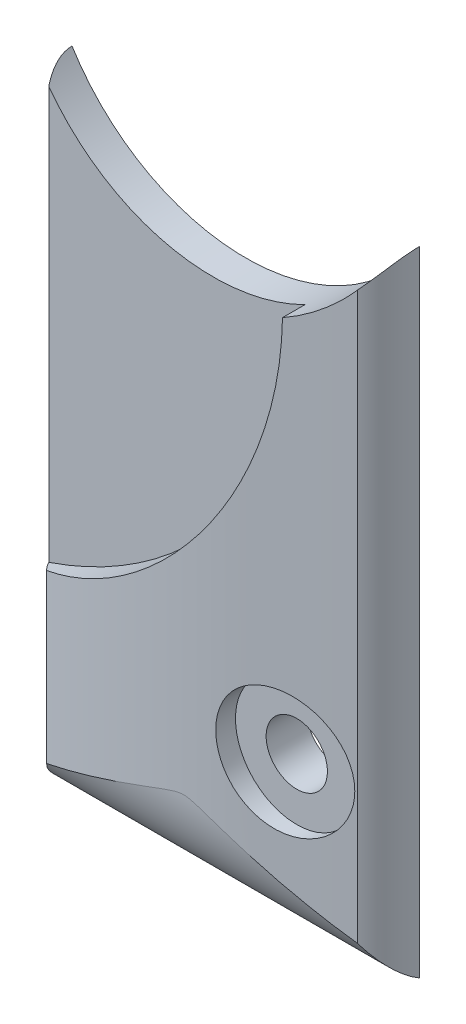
ISO-10303-21;
HEADER;
FILE_DESCRIPTION(('STEP AP214'),'2;1');
FILE_NAME('part.step','',(''),(''),'','','');
FILE_SCHEMA(('AUTOMOTIVE_DESIGN { 1 0 10303 214 1 1 1 1 }'));
ENDSEC;
DATA;
#1=APPLICATION_CONTEXT('core data for automotive mechanical design processes');
#2=APPLICATION_PROTOCOL_DEFINITION('international standard','automotive_design',2000,#1);
#3=PRODUCT_CONTEXT('',#1,'mechanical');
#4=PRODUCT('Part','Part','',(#3));
#5=PRODUCT_RELATED_PRODUCT_CATEGORY('part','',(#4));
#6=PRODUCT_DEFINITION_FORMATION('','',#4);
#7=PRODUCT_DEFINITION_CONTEXT('part definition',#1,'design');
#8=PRODUCT_DEFINITION('design','',#6,#7);
#9=PRODUCT_DEFINITION_SHAPE('','',#8);
#10=(LENGTH_UNIT() NAMED_UNIT(*) SI_UNIT(.MILLI.,.METRE.));
#11=(NAMED_UNIT(*) PLANE_ANGLE_UNIT() SI_UNIT($,.RADIAN.));
#12=(NAMED_UNIT(*) SI_UNIT($,.STERADIAN.) SOLID_ANGLE_UNIT());
#13=UNCERTAINTY_MEASURE_WITH_UNIT(LENGTH_MEASURE(1.E-05),#10,'distance_accuracy_value','');
#14=(GEOMETRIC_REPRESENTATION_CONTEXT(3) GLOBAL_UNCERTAINTY_ASSIGNED_CONTEXT((#13)) GLOBAL_UNIT_ASSIGNED_CONTEXT((#10,
#11,#12)) REPRESENTATION_CONTEXT('',''));
#15=CARTESIAN_POINT('',(0.,0.,0.));
#16=DIRECTION('',(0.,0.,1.));
#17=DIRECTION('',(1.,0.,0.));
#18=AXIS2_PLACEMENT_3D('',#15,#16,#17);
#19=CARTESIAN_POINT('',(-16.,-33.5,3.));
#20=DIRECTION('',(0.,0.,-1.));
#21=DIRECTION('',(-1.,0.,0.));
#22=AXIS2_PLACEMENT_3D('',#19,#20,#21);
#23=CYLINDRICAL_SURFACE('',#22,1.5);
#24=CARTESIAN_POINT('',(-16.,-33.5,0.));
#25=DIRECTION('',(0.,0.,1.));
#26=DIRECTION('',(1.,0.,0.));
#27=AXIS2_PLACEMENT_3D('',#24,#25,#26);
#28=CIRCLE('',#27,1.5);
#29=CARTESIAN_POINT('',(-14.5,-33.5,0.));
#30=VERTEX_POINT('',#29);
#31=EDGE_CURVE('E117',#30,#30,#28,.T.);
#32=ORIENTED_EDGE('',*,*,#31,.F.);
#33=EDGE_LOOP('',(#32));
#34=FACE_BOUND('',#33,.T.);
#35=CARTESIAN_POINT('',(-16.,-33.5,2.));
#36=DIRECTION('',(0.,0.,1.));
#37=DIRECTION('',(1.,0.,0.));
#38=AXIS2_PLACEMENT_3D('',#35,#36,#37);
#39=CIRCLE('',#38,1.5);
#40=CARTESIAN_POINT('',(-14.5,-33.5,2.));
#41=VERTEX_POINT('',#40);
#42=EDGE_CURVE('E123',#41,#41,#39,.T.);
#43=ORIENTED_EDGE('',*,*,#42,.T.);
#44=EDGE_LOOP('',(#43));
#45=FACE_BOUND('',#44,.T.);
#46=ADVANCED_FACE('F32',(#34,#45),#23,.F.);
#47=CARTESIAN_POINT('',(-20.5,-5.73217312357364,0.));
#48=DIRECTION('',(0.,0.,1.));
#49=DIRECTION('',(1.,0.,0.));
#50=AXIS2_PLACEMENT_3D('',#47,#48,#49);
#51=PLANE('',#50);
#52=CARTESIAN_POINT('',(-20.5,-5.73217312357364,0.));
#53=DIRECTION('',(0.,0.,-1.));
#54=DIRECTION('',(1.,0.,0.));
#55=AXIS2_PLACEMENT_3D('',#52,#53,#54);
#56=CIRCLE('',#55,10.);
#57=CARTESIAN_POINT('',(-12.,-11.,0.));
#58=VERTEX_POINT('',#57);
#59=CARTESIAN_POINT('',(-29.,-11.,0.));
#60=VERTEX_POINT('',#59);
#61=EDGE_CURVE('E115',#58,#60,#56,.T.);
#62=ORIENTED_EDGE('',*,*,#61,.F.);
#63=DIRECTION('',(0.,1.,0.));
#64=VECTOR('',#63,1.);
#65=CARTESIAN_POINT('',(-12.,-42.,0.));
#66=LINE('',#65,#64);
#67=CARTESIAN_POINT('',(-12.,-42.,0.));
#68=VERTEX_POINT('',#67);
#69=EDGE_CURVE('E108',#68,#58,#66,.T.);
#70=ORIENTED_EDGE('',*,*,#69,.F.);
#71=DIRECTION('',(1.,0.,0.));
#72=VECTOR('',#71,1.);
#73=CARTESIAN_POINT('',(-29.,-42.,0.));
#74=LINE('',#73,#72);
#75=CARTESIAN_POINT('',(-29.,-42.,0.));
#76=VERTEX_POINT('',#75);
#77=EDGE_CURVE('E93',#76,#68,#74,.T.);
#78=ORIENTED_EDGE('',*,*,#77,.F.);
#79=DIRECTION('',(0.,-1.,0.));
#80=VECTOR('',#79,1.);
#81=CARTESIAN_POINT('',(-29.,-11.,0.));
#82=LINE('',#81,#80);
#83=EDGE_CURVE('E105',#60,#76,#82,.T.);
#84=ORIENTED_EDGE('',*,*,#83,.F.);
#85=EDGE_LOOP('',(#62,#70,#78,#84));
#86=FACE_BOUND('',#85,.T.);
#87=ORIENTED_EDGE('',*,*,#31,.T.);
#88=EDGE_LOOP('',(#87));
#89=FACE_BOUND('',#88,.T.);
#90=ADVANCED_FACE('F103',(#86,#89),#51,.F.);
#91=CARTESIAN_POINT('',(-20.5,-5.73217312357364,3.));
#92=DIRECTION('',(0.,0.,-1.));
#93=DIRECTION('',(-1.,0.,0.));
#94=AXIS2_PLACEMENT_3D('',#91,#92,#93);
#95=CYLINDRICAL_SURFACE('',#94,10.);
#96=CARTESIAN_POINT('',(-20.5,-5.73217312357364,1.6));
#97=DIRECTION('',(0.,0.,-1.));
#98=DIRECTION('',(-1.,0.,0.));
#99=AXIS2_PLACEMENT_3D('',#96,#97,#98);
#100=CIRCLE('',#99,10.);
#101=CARTESIAN_POINT('',(-28.5377155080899,-11.6815537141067,1.6));
#102=VERTEX_POINT('',#101);
#103=CARTESIAN_POINT('',(-16.,-14.6624586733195,1.6));
#104=VERTEX_POINT('',#103);
#105=EDGE_CURVE('E184',#102,#104,#100,.F.);
#106=ORIENTED_EDGE('',*,*,#105,.T.);
#107=DIRECTION('',(0.,0.,1.));
#108=VECTOR('',#107,1.);
#109=CARTESIAN_POINT('',(-16.,-14.6624586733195,1.6));
#110=LINE('',#109,#108);
#111=CARTESIAN_POINT('',(-16.,-14.6624586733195,2.69816443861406));
#112=VERTEX_POINT('',#111);
#113=EDGE_CURVE('E185',#104,#112,#110,.T.);
#114=ORIENTED_EDGE('',*,*,#113,.T.);
#115=CARTESIAN_POINT('',(-28.0834327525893,-12.2507272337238,2.15854301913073));
#116=CARTESIAN_POINT('',(-27.9004058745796,-12.4636839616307,2.19988229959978));
#117=CARTESIAN_POINT('',(-27.7084229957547,-12.6688559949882,2.2416513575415));
#118=CARTESIAN_POINT('',(-27.3078495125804,-13.0623786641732,2.32490135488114));
#119=CARTESIAN_POINT('',(-27.0992579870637,-13.2507283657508,2.36638227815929));
#120=CARTESIAN_POINT('',(-26.6665989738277,-13.6094905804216,2.44793989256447));
#121=CARTESIAN_POINT('',(-26.4425178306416,-13.77988692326,2.48801529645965));
#122=CARTESIAN_POINT('',(-25.9804941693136,-14.1013651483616,2.56561467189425));
#123=CARTESIAN_POINT('',(-25.7425521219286,-14.252447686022,2.60313872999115));
#124=CARTESIAN_POINT('',(-25.2540672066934,-14.5343580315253,2.67463520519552));
#125=CARTESIAN_POINT('',(-25.0035100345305,-14.6651621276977,2.70860344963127));
#126=CARTESIAN_POINT('',(-24.4917483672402,-14.9052765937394,2.77198077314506));
#127=CARTESIAN_POINT('',(-24.2305442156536,-15.0145876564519,2.80138999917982));
#128=CARTESIAN_POINT('',(-23.6995124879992,-15.2107370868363,2.85479003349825));
#129=CARTESIAN_POINT('',(-23.4296915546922,-15.2975923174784,2.8787849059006));
#130=CARTESIAN_POINT('',(-22.8832093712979,-15.4481720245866,2.92068781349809));
#131=CARTESIAN_POINT('',(-22.6065483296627,-15.5118972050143,2.93859603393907));
#132=CARTESIAN_POINT('',(-22.0553180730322,-15.6143610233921,2.96744043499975));
#133=CARTESIAN_POINT('',(-21.7808639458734,-15.6536740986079,2.97853682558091));
#134=CARTESIAN_POINT('',(-21.2294524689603,-15.7093813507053,2.99411996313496));
#135=CARTESIAN_POINT('',(-20.9524951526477,-15.7257758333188,2.99860679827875));
#136=CARTESIAN_POINT('',(-20.3981394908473,-15.735496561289,3.00083822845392));
#137=CARTESIAN_POINT('',(-20.1207411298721,-15.7288219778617,2.99858258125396));
#138=CARTESIAN_POINT('',(-19.5675956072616,-15.6924664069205,2.98738577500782));
#139=CARTESIAN_POINT('',(-19.2918484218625,-15.662785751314,2.97844471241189));
#140=CARTESIAN_POINT('',(-18.7509394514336,-15.5817259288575,2.95442862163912));
#141=CARTESIAN_POINT('',(-18.485685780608,-15.5309106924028,2.93951335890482));
#142=CARTESIAN_POINT('',(-17.960511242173,-15.4081082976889,2.90395155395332));
#143=CARTESIAN_POINT('',(-17.7005905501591,-15.3361204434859,2.88330482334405));
#144=CARTESIAN_POINT('',(-17.1877219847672,-15.1715258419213,2.83680460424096));
#145=CARTESIAN_POINT('',(-16.9347771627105,-15.0789102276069,2.81094887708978));
#146=CARTESIAN_POINT('',(-16.4376141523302,-14.8737995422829,2.75469900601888));
#147=CARTESIAN_POINT('',(-16.193395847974,-14.7613047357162,2.7243049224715));
#148=CARTESIAN_POINT('',(-15.7106155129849,-14.5149200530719,2.65912773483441));
#149=CARTESIAN_POINT('',(-15.4722514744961,-14.3806615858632,2.62427170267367));
#150=CARTESIAN_POINT('',(-15.0076462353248,-14.0933127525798,2.55154891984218));
#151=CARTESIAN_POINT('',(-14.7814050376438,-13.9402223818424,2.513682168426));
#152=CARTESIAN_POINT('',(-14.3427548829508,-13.6164954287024,2.43597459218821));
#153=CARTESIAN_POINT('',(-14.1303258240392,-13.4458853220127,2.39613679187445));
#154=CARTESIAN_POINT('',(-13.7202810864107,-13.0880814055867,2.31547202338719));
#155=CARTESIAN_POINT('',(-13.5226575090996,-12.9008965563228,2.27464559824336));
#156=CARTESIAN_POINT('',(-13.2571906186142,-12.6280813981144,2.21753851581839));
#157=CARTESIAN_POINT('',(-13.1826268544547,-12.548908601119,2.20122864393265));
#158=CARTESIAN_POINT('',(-13.0362045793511,-12.3882642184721,2.16870461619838));
#159=CARTESIAN_POINT('',(-12.9643428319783,-12.3067956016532,2.15249036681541));
#160=CARTESIAN_POINT('',(-12.8938124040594,-12.2241612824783,2.13634590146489));
#161=B_SPLINE_CURVE_WITH_KNOTS('',3,(#115,#116,#117,#118,#119,#120,#121,#122,#123,#124,#125,
#126,#127,#128,#129,#130,#131,#132,#133,#134,#135,#136,#137,#138,#139,#140,#141,#142,#143,#144,
#145,#146,#147,#148,#149,#150,#151,#152,#153,#154,#155,#156,#157,#158,#159,#160),.UNSPECIFIED.,
.F.,.F.,(4,2,2,2,2,2,2,2,2,2,2,2,2,2,2,2,2,2,2,2,2,2,4),(0.,0.851234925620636,1.70251709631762,
2.55455956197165,3.4065731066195,4.25957551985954,5.11255043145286,5.96488293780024,
6.81718950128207,7.64859435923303,8.47998812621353,9.31141176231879,10.1428234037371,
10.9533451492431,11.7638935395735,12.574791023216,13.3856777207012,14.2120990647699,
15.0385206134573,15.8637111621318,16.6884582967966,17.0183324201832,17.3477979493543),.UNSPECIFIED.);
#162=CARTESIAN_POINT('',(-12.8938124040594,-12.2241612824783,2.13634590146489));
#163=VERTEX_POINT('',#162);
#164=EDGE_CURVE('E197',#112,#163,#161,.T.);
#165=ORIENTED_EDGE('',*,*,#164,.T.);
#166=CARTESIAN_POINT('',(-15.,-14.0838196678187,3.));
#167=CARTESIAN_POINT('',(-14.8930200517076,-14.0133933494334,2.99999077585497));
#168=CARTESIAN_POINT('',(-14.7874834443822,-13.9409207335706,2.99427988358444));
#169=CARTESIAN_POINT('',(-14.5800925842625,-13.7926207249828,2.97229701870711));
#170=CARTESIAN_POINT('',(-14.4782343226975,-13.7167971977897,2.95603693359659));
#171=CARTESIAN_POINT('',(-14.2791876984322,-13.5627090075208,2.91388641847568));
#172=CARTESIAN_POINT('',(-14.1819808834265,-13.4844564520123,2.88803835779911));
#173=CARTESIAN_POINT('',(-13.9921961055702,-13.3258424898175,2.82741178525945));
#174=CARTESIAN_POINT('',(-13.899619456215,-13.2454804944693,2.79263075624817));
#175=CARTESIAN_POINT('',(-13.6337929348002,-13.006160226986,2.67771375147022));
#176=CARTESIAN_POINT('',(-13.4673644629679,-12.8449925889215,2.58586099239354));
#177=CARTESIAN_POINT('',(-13.2331467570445,-12.6028062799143,2.42634962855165));
#178=CARTESIAN_POINT('',(-13.1575575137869,-12.5219003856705,2.36946967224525));
#179=CARTESIAN_POINT('',(-13.0116903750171,-12.3606719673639,2.24846690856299));
#180=CARTESIAN_POINT('',(-12.9414117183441,-12.2803493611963,2.18434514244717));
#181=CARTESIAN_POINT('',(-12.818593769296,-12.1355572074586,2.06097500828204));
#182=CARTESIAN_POINT('',(-12.7651385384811,-12.0708367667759,2.00292725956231));
#183=CARTESIAN_POINT('',(-12.6621738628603,-11.9430672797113,1.88172563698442));
#184=CARTESIAN_POINT('',(-12.6126636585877,-11.8800179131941,1.8185727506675));
#185=CARTESIAN_POINT('',(-12.5179409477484,-11.7565216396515,1.6869926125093));
#186=CARTESIAN_POINT('',(-12.4727206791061,-11.6960701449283,1.61857530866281));
#187=CARTESIAN_POINT('',(-12.3869036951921,-11.5787915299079,1.47602295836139));
#188=CARTESIAN_POINT('',(-12.3463044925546,-11.521962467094,1.40189102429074));
#189=CARTESIAN_POINT('',(-12.2624541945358,-11.4021999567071,1.2315166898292));
#190=CARTESIAN_POINT('',(-12.2203766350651,-11.3404168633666,1.13386357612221));
#191=CARTESIAN_POINT('',(-12.1453734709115,-11.2280606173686,0.928956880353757));
#192=CARTESIAN_POINT('',(-12.112436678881,-11.177473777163,0.821715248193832));
#193=CARTESIAN_POINT('',(-12.0635696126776,-11.1013689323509,0.621078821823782));
#194=CARTESIAN_POINT('',(-12.0455362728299,-11.0728366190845,0.529360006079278));
#195=CARTESIAN_POINT('',(-12.0180216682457,-11.0290342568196,0.341648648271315));
#196=CARTESIAN_POINT('',(-12.0085151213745,-11.013725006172,0.245669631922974));
#197=CARTESIAN_POINT('',(-12.0024688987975,-11.0039816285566,0.124222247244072));
#198=CARTESIAN_POINT('',(-12.0015438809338,-11.0024902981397,0.099409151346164));
#199=CARTESIAN_POINT('',(-12.0003100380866,-11.0005005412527,0.0497337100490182));
#200=CARTESIAN_POINT('',(-12.0000010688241,-11.0000018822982,0.0248713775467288));
#201=CARTESIAN_POINT('',(-12.,-11.0000000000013,-1.04382185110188E-13));
#202=B_SPLINE_CURVE_WITH_KNOTS('',3,(#166,#167,#168,#169,#170,#171,#172,#173,#174,#175,#176,
#177,#178,#179,#180,#181,#182,#183,#184,#185,#186,#187,#188,#189,#190,#191,#192,#193,#194,#195,
#196,#197,#198,#199,#200,#201),.UNSPECIFIED.,.F.,.F.,(4,2,2,2,2,2,2,2,2,2,2,2,2,2,2,2,2,4),(0.,
0.38397235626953,0.767512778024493,1.1493781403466,1.53135122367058,2.27583953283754,
2.64904780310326,3.02220247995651,3.32818345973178,3.63410539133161,3.9394627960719,
4.24465505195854,4.61265091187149,4.98019437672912,5.27229694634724,5.56353053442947,
5.63813728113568,5.71272655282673),.UNSPECIFIED.);
#203=EDGE_CURVE('E122',#163,#58,#202,.T.);
#204=ORIENTED_EDGE('',*,*,#203,.T.);
#205=ORIENTED_EDGE('',*,*,#61,.T.);
#206=CARTESIAN_POINT('',(-29.,-11.,0.));
#207=CARTESIAN_POINT('',(-29.0000104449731,-10.9999772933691,0.0490031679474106));
#208=CARTESIAN_POINT('',(-28.9987997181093,-11.0019366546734,0.0979918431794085));
#209=CARTESIAN_POINT('',(-28.9940183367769,-11.0096430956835,0.195490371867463));
#210=CARTESIAN_POINT('',(-28.9904508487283,-11.0153850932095,0.244000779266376));
#211=CARTESIAN_POINT('',(-28.9810969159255,-11.0303867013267,0.33962371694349));
#212=CARTESIAN_POINT('',(-28.9753388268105,-11.0396013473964,0.386746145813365));
#213=CARTESIAN_POINT('',(-28.9617359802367,-11.06126204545,0.479938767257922));
#214=CARTESIAN_POINT('',(-28.9538904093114,-11.0737093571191,0.526008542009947));
#215=CARTESIAN_POINT('',(-28.9222232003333,-11.1236454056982,0.689177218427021));
#216=CARTESIAN_POINT('',(-28.8928367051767,-11.1694775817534,0.802720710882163));
#217=CARTESIAN_POINT('',(-28.8235505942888,-11.2749595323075,1.02016645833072));
#218=CARTESIAN_POINT('',(-28.7835900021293,-11.334689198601,1.12400790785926));
#219=CARTESIAN_POINT('',(-28.7034797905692,-11.4511733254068,1.30343588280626));
#220=CARTESIAN_POINT('',(-28.66475606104,-11.5064042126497,1.3806796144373));
#221=CARTESIAN_POINT('',(-28.5823979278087,-11.62113144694,1.52919581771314));
#222=CARTESIAN_POINT('',(-28.5387604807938,-11.6806304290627,1.60046454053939));
#223=CARTESIAN_POINT('',(-28.4470148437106,-11.8026586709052,1.73750556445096));
#224=CARTESIAN_POINT('',(-28.3989000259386,-11.8651923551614,1.80326943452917));
#225=CARTESIAN_POINT('',(-28.2985712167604,-11.992272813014,1.92952629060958));
#226=CARTESIAN_POINT('',(-28.2463561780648,-12.0568200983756,1.99001792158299));
#227=CARTESIAN_POINT('',(-28.1162812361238,-12.2134046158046,2.12925580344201));
#228=CARTESIAN_POINT('',(-28.036549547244,-12.3060627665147,2.20556604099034));
#229=CARTESIAN_POINT('',(-27.8698808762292,-12.4923875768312,2.34853116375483));
#230=CARTESIAN_POINT('',(-27.7829412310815,-12.5860545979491,2.41518245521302));
#231=CARTESIAN_POINT('',(-27.6023619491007,-12.7730047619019,2.53857596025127));
#232=CARTESIAN_POINT('',(-27.5087365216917,-12.8662882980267,2.59533835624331));
#233=CARTESIAN_POINT('',(-27.3149307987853,-13.0516464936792,2.69870573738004));
#234=CARTESIAN_POINT('',(-27.214751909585,-13.1437214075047,2.74531289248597));
#235=CARTESIAN_POINT('',(-27.0264790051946,-13.3096339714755,2.8204100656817));
#236=CARTESIAN_POINT('',(-26.9393825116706,-13.3838162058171,2.8506465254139));
#237=CARTESIAN_POINT('',(-26.7612958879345,-13.5302150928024,2.90328195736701));
#238=CARTESIAN_POINT('',(-26.6703071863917,-13.6024324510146,2.92568377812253));
#239=CARTESIAN_POINT('',(-26.4845350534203,-13.7446028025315,2.96212901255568));
#240=CARTESIAN_POINT('',(-26.3897422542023,-13.8145493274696,2.97615024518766));
#241=CARTESIAN_POINT('',(-26.1970444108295,-13.9515261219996,2.99508760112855));
#242=CARTESIAN_POINT('',(-26.0991361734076,-14.0185532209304,2.99999405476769));
#243=CARTESIAN_POINT('',(-26.,-14.0838196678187,3.));
#244=B_SPLINE_CURVE_WITH_KNOTS('',3,(#206,#207,#208,#209,#210,#211,#212,#213,#214,#215,#216,
#217,#218,#219,#220,#221,#222,#223,#224,#225,#226,#227,#228,#229,#230,#231,#232,#233,#234,#235,
#236,#237,#238,#239,#240,#241,#242,#243),.UNSPECIFIED.,.F.,.F.,(4,2,2,2,2,2,2,2,2,2,2,2,2,2,2,2,
2,2,4),(0.,0.146931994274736,0.293666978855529,0.438563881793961,0.583517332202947,
0.958990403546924,1.33667773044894,1.64390843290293,1.95133047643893,2.25921505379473,
2.56717852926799,2.99892995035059,3.43084160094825,3.86186115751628,4.29278852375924,
4.6474778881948,5.0020381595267,5.35753274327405,5.71340424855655),.UNSPECIFIED.);
#245=EDGE_CURVE('E114',#60,#102,#244,.T.);
#246=ORIENTED_EDGE('',*,*,#245,.T.);
#247=EDGE_LOOP('',(#106,#114,#165,#204,#205,#246));
#248=FACE_BOUND('',#247,.T.);
#249=ADVANCED_FACE('F34',(#248),#95,.F.);
#250=CARTESIAN_POINT('',(-16.,-33.5,2.));
#251=DIRECTION('',(0.,0.,1.));
#252=DIRECTION('',(1.,0.,0.));
#253=AXIS2_PLACEMENT_3D('',#250,#251,#252);
#254=CYLINDRICAL_SURFACE('',#253,3.);
#255=CARTESIAN_POINT('',(-13.,-33.5,2.16047496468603));
#256=CARTESIAN_POINT('',(-13.0000076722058,-33.3342058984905,2.16047779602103));
#257=CARTESIAN_POINT('',(-13.0137951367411,-33.1682980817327,2.16359585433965));
#258=CARTESIAN_POINT('',(-13.0685387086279,-32.8411326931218,2.1758719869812));
#259=CARTESIAN_POINT('',(-13.1095257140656,-32.6798806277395,2.1850369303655));
#260=CARTESIAN_POINT('',(-13.2173077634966,-32.3668703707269,2.20879454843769));
#261=CARTESIAN_POINT('',(-13.284074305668,-32.2151019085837,2.22338122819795));
#262=CARTESIAN_POINT('',(-13.4413542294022,-31.9250211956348,2.25706876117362));
#263=CARTESIAN_POINT('',(-13.5318639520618,-31.7867068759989,2.2761689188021));
#264=CARTESIAN_POINT('',(-13.7353416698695,-31.5253855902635,2.31803926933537));
#265=CARTESIAN_POINT('',(-13.8485883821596,-31.4026029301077,2.34085426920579));
#266=CARTESIAN_POINT('',(-14.0935894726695,-31.1776595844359,2.38870360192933));
#267=CARTESIAN_POINT('',(-14.2253463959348,-31.075501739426,2.41373823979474));
#268=CARTESIAN_POINT('',(-14.506644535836,-30.8925872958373,2.46526991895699));
#269=CARTESIAN_POINT('',(-14.6564930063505,-30.8123083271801,2.49178634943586));
#270=CARTESIAN_POINT('',(-14.9676247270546,-30.6781378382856,2.54452847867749));
#271=CARTESIAN_POINT('',(-15.1289085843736,-30.624247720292,2.57075416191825));
#272=CARTESIAN_POINT('',(-15.4596660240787,-30.544124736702,2.62198792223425));
#273=CARTESIAN_POINT('',(-15.6291903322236,-30.5180943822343,2.64698584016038));
#274=CARTESIAN_POINT('',(-15.9705228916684,-30.4952729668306,2.6946494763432));
#275=CARTESIAN_POINT('',(-16.1423310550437,-30.4984807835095,2.71731528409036));
#276=CARTESIAN_POINT('',(-16.4820393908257,-30.5340940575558,2.75953246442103));
#277=CARTESIAN_POINT('',(-16.6499586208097,-30.5662926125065,2.77910475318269));
#278=CARTESIAN_POINT('',(-16.9782157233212,-30.6588438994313,2.81499651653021));
#279=CARTESIAN_POINT('',(-17.1385540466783,-30.7191949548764,2.83131618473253));
#280=CARTESIAN_POINT('',(-17.4451943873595,-30.8656183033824,2.86049313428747));
#281=CARTESIAN_POINT('',(-17.591630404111,-30.9514029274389,2.87338623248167));
#282=CARTESIAN_POINT('',(-17.8681174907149,-31.1465419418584,2.89612394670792));
#283=CARTESIAN_POINT('',(-17.9981691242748,-31.2558955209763,2.90596866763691));
#284=CARTESIAN_POINT('',(-18.2373303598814,-31.4943344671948,2.92290267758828));
#285=CARTESIAN_POINT('',(-18.3465625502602,-31.6232957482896,2.93000836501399));
#286=CARTESIAN_POINT('',(-18.5418988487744,-31.8977755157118,2.94196759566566));
#287=CARTESIAN_POINT('',(-18.6280031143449,-32.043293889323,2.94682115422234));
#288=CARTESIAN_POINT('',(-18.7745256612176,-32.3465944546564,2.95468689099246));
#289=CARTESIAN_POINT('',(-18.8349700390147,-32.5043639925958,2.95770094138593));
#290=CARTESIAN_POINT('',(-18.9285699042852,-32.827820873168,2.96223063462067));
#291=CARTESIAN_POINT('',(-18.9617253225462,-32.9935082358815,2.96374627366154));
#292=CARTESIAN_POINT('',(-18.9998108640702,-33.3281951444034,2.96547898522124));
#293=CARTESIAN_POINT('',(-19.0047254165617,-33.4971964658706,2.96569534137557));
#294=CARTESIAN_POINT('',(-18.9861472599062,-33.8336276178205,2.96485810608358));
#295=CARTESIAN_POINT('',(-18.9626544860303,-34.0010574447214,2.96380451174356));
#296=CARTESIAN_POINT('',(-18.8879240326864,-34.3296307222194,2.96028325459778));
#297=CARTESIAN_POINT('',(-18.8366801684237,-34.4907727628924,2.9578152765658));
#298=CARTESIAN_POINT('',(-18.707911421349,-34.8021520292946,2.95117057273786));
#299=CARTESIAN_POINT('',(-18.630386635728,-34.9523892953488,2.94699385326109));
#300=CARTESIAN_POINT('',(-18.4513191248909,-35.2376368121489,2.93653830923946));
#301=CARTESIAN_POINT('',(-18.3497851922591,-35.3726526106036,2.93026025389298));
#302=CARTESIAN_POINT('',(-18.12561918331,-35.6236901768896,2.91517615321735));
#303=CARTESIAN_POINT('',(-18.0029873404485,-35.7397121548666,2.90637013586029));
#304=CARTESIAN_POINT('',(-17.7402423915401,-35.9494488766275,2.88585982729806));
#305=CARTESIAN_POINT('',(-17.6001371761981,-36.0431736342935,2.8741568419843));
#306=CARTESIAN_POINT('',(-17.3064664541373,-36.2057934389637,2.84760854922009));
#307=CARTESIAN_POINT('',(-17.1529009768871,-36.2746885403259,2.83276324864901));
#308=CARTESIAN_POINT('',(-16.8364247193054,-36.3859283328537,2.79985760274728));
#309=CARTESIAN_POINT('',(-16.6734961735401,-36.4282206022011,2.78179099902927));
#310=CARTESIAN_POINT('',(-16.3432171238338,-36.4850098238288,2.74267310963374));
#311=CARTESIAN_POINT('',(-16.1758664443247,-36.4995056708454,2.72162170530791));
#312=CARTESIAN_POINT('',(-15.8401606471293,-36.5004730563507,2.67684701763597));
#313=CARTESIAN_POINT('',(-15.6718074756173,-36.4867323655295,2.65310477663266));
#314=CARTESIAN_POINT('',(-15.3400255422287,-36.4313353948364,2.60383905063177));
#315=CARTESIAN_POINT('',(-15.1765971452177,-36.3896770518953,2.57831543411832));
#316=CARTESIAN_POINT('',(-14.8573528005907,-36.27906624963,2.52619600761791));
#317=CARTESIAN_POINT('',(-14.7016411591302,-36.2098167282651,2.49959145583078));
#318=CARTESIAN_POINT('',(-14.4041001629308,-36.0459673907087,2.44679990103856));
#319=CARTESIAN_POINT('',(-14.2622710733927,-35.9513670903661,2.42061290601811));
#320=CARTESIAN_POINT('',(-13.9958477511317,-35.7388702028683,2.36988013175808));
#321=CARTESIAN_POINT('',(-13.8713354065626,-35.6208689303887,2.34534241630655));
#322=CARTESIAN_POINT('',(-13.643935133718,-35.3650063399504,2.29942947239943));
#323=CARTESIAN_POINT('',(-13.5410512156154,-35.2271413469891,2.27805483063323));
#324=CARTESIAN_POINT('',(-13.3610605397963,-34.9369601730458,2.23999613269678));
#325=CARTESIAN_POINT('',(-13.2836943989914,-34.7848109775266,2.22326517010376));
#326=CARTESIAN_POINT('',(-13.1558172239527,-34.469289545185,2.19530438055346));
#327=CARTESIAN_POINT('',(-13.1052707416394,-34.3059324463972,2.18406729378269));
#328=CARTESIAN_POINT('',(-13.0460541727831,-34.034566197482,2.1708372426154));
#329=CARTESIAN_POINT('',(-13.0288096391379,-33.9284418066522,2.1669623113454));
#330=CARTESIAN_POINT('',(-13.0057801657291,-33.714894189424,2.16178027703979));
#331=CARTESIAN_POINT('',(-12.9999950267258,-33.6074709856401,2.16047312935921));
#332=CARTESIAN_POINT('',(-13.,-33.5,2.16047496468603));
#333=B_SPLINE_CURVE_WITH_KNOTS('',3,(#255,#256,#257,#258,#259,#260,#261,#262,#263,#264,#265,
#266,#267,#268,#269,#270,#271,#272,#273,#274,#275,#276,#277,#278,#279,#280,#281,#282,#283,#284,
#285,#286,#287,#288,#289,#290,#291,#292,#293,#294,#295,#296,#297,#298,#299,#300,#301,#302,#303,
#304,#305,#306,#307,#308,#309,#310,#311,#312,#313,#314,#315,#316,#317,#318,#319,#320,#321,#322,
#323,#324,#325,#326,#327,#328,#329,#330,#331,#332),.UNSPECIFIED.,.T.,.F.,(4,2,2,2,2,2,2,2,2,2,2,
2,2,2,2,2,2,2,2,2,2,2,2,2,2,2,2,2,2,2,2,2,2,2,2,2,2,2,4),(0.,0.496984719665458,
0.994534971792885,1.49153670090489,1.98846188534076,2.49189793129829,2.99540326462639,
3.50915116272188,4.02292635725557,4.54041130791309,5.05787639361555,5.57167743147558,
6.08544787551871,6.59361561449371,7.10176586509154,7.6068247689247,8.11188023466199,
8.61642081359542,9.12096267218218,9.62578268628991,10.1306038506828,10.6355375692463,
11.1404694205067,11.645216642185,12.1499582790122,12.6544728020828,13.1589862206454,
13.6644907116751,14.1700153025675,14.6793533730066,15.1887290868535,15.7037439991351,
16.2187687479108,16.736151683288,17.2536304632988,17.7656742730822,18.2770396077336,
18.5992004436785,18.9213556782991),.UNSPECIFIED.);
#334=CARTESIAN_POINT('',(-13.,-33.5,2.16047496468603));
#335=VERTEX_POINT('',#334);
#336=EDGE_CURVE('E190',#335,#335,#333,.T.);
#337=ORIENTED_EDGE('',*,*,#336,.T.);
#338=EDGE_LOOP('',(#337));
#339=FACE_BOUND('',#338,.T.);
#340=CARTESIAN_POINT('',(-16.,-33.5,2.));
#341=DIRECTION('',(0.,0.,1.));
#342=DIRECTION('',(1.,0.,0.));
#343=AXIS2_PLACEMENT_3D('',#340,#341,#342);
#344=CIRCLE('',#343,3.);
#345=CARTESIAN_POINT('',(-13.,-33.5,2.));
#346=VERTEX_POINT('',#345);
#347=EDGE_CURVE('E126',#346,#346,#344,.T.);
#348=ORIENTED_EDGE('',*,*,#347,.F.);
#349=EDGE_LOOP('',(#348));
#350=FACE_BOUND('',#349,.T.);
#351=ADVANCED_FACE('F203',(#339,#350),#254,.F.);
#352=CARTESIAN_POINT('',(-16.,-33.5,2.));
#353=DIRECTION('',(0.,0.,1.));
#354=DIRECTION('',(1.,0.,0.));
#355=AXIS2_PLACEMENT_3D('',#352,#353,#354);
#356=PLANE('',#355);
#357=ORIENTED_EDGE('',*,*,#42,.F.);
#358=EDGE_LOOP('',(#357));
#359=FACE_BOUND('',#358,.T.);
#360=ORIENTED_EDGE('',*,*,#347,.T.);
#361=EDGE_LOOP('',(#360));
#362=FACE_BOUND('',#361,.T.);
#363=ADVANCED_FACE('F207',(#359,#362),#356,.T.);
#364=CARTESIAN_POINT('',(-26.,-5.73217312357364,0.));
#365=DIRECTION('',(0.,1.,0.));
#366=DIRECTION('',(0.,0.,1.));
#367=AXIS2_PLACEMENT_3D('',#364,#365,#366);
#368=CYLINDRICAL_SURFACE('',#367,3.);
#369=CARTESIAN_POINT('',(-28.0834327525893,-39.8716767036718,2.15854301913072));
#370=CARTESIAN_POINT('',(-28.1599621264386,-39.9957813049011,2.08463901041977));
#371=CARTESIAN_POINT('',(-28.2338564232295,-40.1185321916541,2.00548044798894));
#372=CARTESIAN_POINT('',(-28.375022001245,-40.3607575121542,1.83616503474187));
#373=CARTESIAN_POINT('',(-28.4422755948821,-40.4802226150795,1.74598017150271));
#374=CARTESIAN_POINT('',(-28.5661400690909,-40.7104649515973,1.55792514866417));
#375=CARTESIAN_POINT('',(-28.6230453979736,-40.8214000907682,1.46044482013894));
#376=CARTESIAN_POINT('',(-28.7272403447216,-41.0379681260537,1.25514765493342));
#377=CARTESIAN_POINT('',(-28.7745398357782,-41.1436063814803,1.14734160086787));
#378=CARTESIAN_POINT('',(-28.8440894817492,-41.3153495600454,0.9580117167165));
#379=CARTESIAN_POINT('',(-28.8694977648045,-41.3832125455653,0.879231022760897));
#380=CARTESIAN_POINT('',(-28.9142166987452,-41.515508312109,0.717217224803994));
#381=CARTESIAN_POINT('',(-28.9335299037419,-41.5799425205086,0.633986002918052));
#382=CARTESIAN_POINT('',(-28.9656566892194,-41.7064379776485,0.461277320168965));
#383=CARTESIAN_POINT('',(-28.9783005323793,-41.7684032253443,0.371697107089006));
#384=CARTESIAN_POINT('',(-28.995479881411,-41.8877868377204,0.188613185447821));
#385=CARTESIAN_POINT('',(-29.0000022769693,-41.9451977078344,0.0951033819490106));
#386=CARTESIAN_POINT('',(-29.,-42.,0.));
#387=B_SPLINE_CURVE_WITH_KNOTS('',3,(#369,#370,#371,#372,#373,#374,#375,#376,#377,#378,#379,
#380,#381,#382,#383,#384,#385,#386),.UNSPECIFIED.,.F.,.F.,(4,2,2,2,2,2,2,2,4),(0.,
0.49045618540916,0.982185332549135,1.45634143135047,1.93000768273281,2.2508437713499,
2.57154523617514,2.90005665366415,3.22909790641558),.UNSPECIFIED.);
#388=CARTESIAN_POINT('',(-28.0834327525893,-39.8716767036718,2.15854301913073));
#389=VERTEX_POINT('',#388);
#390=EDGE_CURVE('E90',#389,#76,#387,.T.);
#391=ORIENTED_EDGE('',*,*,#390,.F.);
#392=DIRECTION('',(0.,-1.,0.));
#393=VECTOR('',#392,1.);
#394=CARTESIAN_POINT('',(-28.0834327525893,-10.7097533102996,2.15854301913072));
#395=LINE('',#394,#393);
#396=CARTESIAN_POINT('',(-28.0834327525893,-31.6905748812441,2.15854301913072));
#397=VERTEX_POINT('',#396);
#398=EDGE_CURVE('E188',#397,#389,#395,.T.);
#399=ORIENTED_EDGE('',*,*,#398,.F.);
#400=CARTESIAN_POINT('',(-28.5377155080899,-31.8506333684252,1.6));
#401=CARTESIAN_POINT('',(-28.5053117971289,-31.8396899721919,1.65140056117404));
#402=CARTESIAN_POINT('',(-28.4714008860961,-31.8281373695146,1.70171861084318));
#403=CARTESIAN_POINT('',(-28.4008829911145,-31.8038639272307,1.79983103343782));
#404=CARTESIAN_POINT('',(-28.3642868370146,-31.7911477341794,1.84763433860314));
#405=CARTESIAN_POINT('',(-28.2884661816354,-31.7645135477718,1.94075441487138));
#406=CARTESIAN_POINT('',(-28.2492417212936,-31.7505955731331,1.98607122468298));
#407=CARTESIAN_POINT('',(-28.1682042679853,-31.7215116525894,2.07424539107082));
#408=CARTESIAN_POINT('',(-28.1263818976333,-31.706341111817,2.11709261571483));
#409=CARTESIAN_POINT('',(-28.0834327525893,-31.6905748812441,2.15854301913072));
#410=B_SPLINE_CURVE_WITH_KNOTS('',3,(#400,#401,#402,#403,#404,#405,#406,#407,#408,#409),
.UNSPECIFIED.,.F.,.F.,(4,2,2,2,4),(0.,0.18518488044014,0.369660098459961,0.554132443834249,
0.739314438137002),.UNSPECIFIED.);
#411=CARTESIAN_POINT('',(-28.5377155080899,-31.8506333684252,1.6));
#412=VERTEX_POINT('',#411);
#413=EDGE_CURVE('E61',#412,#397,#410,.T.);
#414=ORIENTED_EDGE('',*,*,#413,.F.);
#415=DIRECTION('',(0.,1.,0.));
#416=VECTOR('',#415,1.);
#417=CARTESIAN_POINT('',(-28.5377155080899,-5.73217312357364,1.6));
#418=LINE('',#417,#416);
#419=EDGE_CURVE('E47',#102,#412,#418,.F.);
#420=ORIENTED_EDGE('',*,*,#419,.F.);
#421=ORIENTED_EDGE('',*,*,#245,.F.);
#422=ORIENTED_EDGE('',*,*,#83,.T.);
#423=EDGE_LOOP('',(#391,#399,#414,#420,#421,#422));
#424=FACE_BOUND('',#423,.T.);
#425=ADVANCED_FACE('F111',(#424),#368,.T.);
#426=CARTESIAN_POINT('',(-15.,-5.73217312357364,0.));
#427=DIRECTION('',(0.,-1.,0.));
#428=DIRECTION('',(0.,0.,-1.));
#429=AXIS2_PLACEMENT_3D('',#426,#427,#428);
#430=CYLINDRICAL_SURFACE('',#429,3.);
#431=CARTESIAN_POINT('',(-12.,-42.0000000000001,-1.04100572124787E-13));
#432=CARTESIAN_POINT('',(-11.9999990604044,-41.9347922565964,0.113190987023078));
#433=CARTESIAN_POINT('',(-12.0064010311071,-41.8658945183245,0.224078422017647));
#434=CARTESIAN_POINT('',(-12.0304692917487,-41.7218310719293,0.440063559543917));
#435=CARTESIAN_POINT('',(-12.0481082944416,-41.6466809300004,0.545174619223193));
#436=CARTESIAN_POINT('',(-12.0925208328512,-41.4929866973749,0.746251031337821));
#437=CARTESIAN_POINT('',(-12.119037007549,-41.4145874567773,0.84238595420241));
#438=CARTESIAN_POINT('',(-12.1800204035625,-41.2533343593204,1.02824324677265));
#439=CARTESIAN_POINT('',(-12.2144920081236,-41.1704780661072,1.11796204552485));
#440=CARTESIAN_POINT('',(-12.2925437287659,-40.9958458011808,1.29603409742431));
#441=CARTESIAN_POINT('',(-12.3365525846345,-40.9038343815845,1.38396670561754));
#442=CARTESIAN_POINT('',(-12.4310218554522,-40.7163075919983,1.5523103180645));
#443=CARTESIAN_POINT('',(-12.4814835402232,-40.6207915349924,1.632719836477));
#444=CARTESIAN_POINT('',(-12.5894139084,-40.4239618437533,1.78838471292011));
#445=CARTESIAN_POINT('',(-12.6470472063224,-40.3225602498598,1.86341352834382));
#446=CARTESIAN_POINT('',(-12.7670768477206,-40.1173241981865,2.00566153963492));
#447=CARTESIAN_POINT('',(-12.8294678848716,-40.0134925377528,2.07288923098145));
#448=CARTESIAN_POINT('',(-12.8938124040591,-39.9086515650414,2.13634590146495));
#449=B_SPLINE_CURVE_WITH_KNOTS('',3,(#431,#432,#433,#434,#435,#436,#437,#438,#439,#440,#441,
#442,#443,#444,#445,#446,#447,#448),.UNSPECIFIED.,.F.,.F.,(4,2,2,2,2,2,2,2,4),(0.,
0.39144211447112,0.781937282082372,1.1619715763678,1.54221576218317,1.9457628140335,
2.34938940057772,2.76510654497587,3.18036663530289),.UNSPECIFIED.);
#450=CARTESIAN_POINT('',(-12.8938124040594,-39.9086515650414,2.13634590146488));
#451=VERTEX_POINT('',#450);
#452=EDGE_CURVE('E54',#68,#451,#449,.T.);
#453=ORIENTED_EDGE('',*,*,#452,.F.);
#454=ORIENTED_EDGE('',*,*,#69,.T.);
#455=ORIENTED_EDGE('',*,*,#203,.F.);
#456=DIRECTION('',(0.,-1.,0.));
#457=VECTOR('',#456,1.);
#458=CARTESIAN_POINT('',(-12.8938124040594,-5.73217312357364,2.13634590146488));
#459=LINE('',#458,#457);
#460=EDGE_CURVE('E222',#451,#163,#459,.F.);
#461=ORIENTED_EDGE('',*,*,#460,.F.);
#462=EDGE_LOOP('',(#453,#454,#455,#461));
#463=FACE_BOUND('',#462,.T.);
#464=ADVANCED_FACE('F139',(#463),#430,.T.);
#465=CARTESIAN_POINT('',(-20.5374363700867,-10.7097533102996,-31.2561251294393));
#466=DIRECTION('',(0.,-1.,0.));
#467=DIRECTION('',(0.,0.,-1.));
#468=AXIS2_PLACEMENT_3D('',#465,#466,#467);
#469=CYLINDRICAL_SURFACE('',#468,34.2561251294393);
#470=ORIENTED_EDGE('',*,*,#398,.T.);
#471=CARTESIAN_POINT('',(-28.0834327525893,-39.8716767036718,2.15854301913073));
#472=CARTESIAN_POINT('',(-27.8523850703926,-39.7840496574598,2.21071956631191));
#473=CARTESIAN_POINT('',(-27.6211340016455,-39.6954943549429,2.26042480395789));
#474=CARTESIAN_POINT('',(-27.1582691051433,-39.5167424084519,2.35492196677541));
#475=CARTESIAN_POINT('',(-26.9266552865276,-39.426545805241,2.39971401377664));
#476=CARTESIAN_POINT('',(-26.4624630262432,-39.2444732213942,2.48453260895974));
#477=CARTESIAN_POINT('',(-26.2298836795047,-39.1525933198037,2.52454577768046));
#478=CARTESIAN_POINT('',(-25.7644229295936,-38.9676088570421,2.59969115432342));
#479=CARTESIAN_POINT('',(-25.531541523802,-38.8745042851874,2.63482331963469));
#480=CARTESIAN_POINT('',(-25.0005330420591,-38.6611891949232,2.70934892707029));
#481=CARTESIAN_POINT('',(-24.7023169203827,-38.5406583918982,2.74719967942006));
#482=CARTESIAN_POINT('',(-24.1054262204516,-38.2984801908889,2.81500305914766));
#483=CARTESIAN_POINT('',(-23.806751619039,-38.1768327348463,2.84495527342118));
#484=CARTESIAN_POINT('',(-23.209866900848,-37.9335090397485,2.89690858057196));
#485=CARTESIAN_POINT('',(-22.9116584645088,-37.8118341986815,2.91893538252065));
#486=CARTESIAN_POINT('',(-22.4636195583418,-37.6303056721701,2.94613057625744));
#487=CARTESIAN_POINT('',(-22.3141600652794,-37.5699632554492,2.95422120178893));
#488=CARTESIAN_POINT('',(-22.0147979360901,-37.4501597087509,2.96845649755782));
#489=CARTESIAN_POINT('',(-21.8648953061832,-37.3906985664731,2.97460119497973));
#490=CARTESIAN_POINT('',(-21.6153107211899,-37.2940331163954,2.98318173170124));
#491=CARTESIAN_POINT('',(-21.5159178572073,-37.2561476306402,2.98616793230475));
#492=CARTESIAN_POINT('',(-21.3155703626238,-37.1824174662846,2.99130905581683));
#493=CARTESIAN_POINT('',(-21.214609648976,-37.1465892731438,2.99345789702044));
#494=CARTESIAN_POINT('',(-21.0182296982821,-37.0830571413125,2.996756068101));
#495=CARTESIAN_POINT('',(-20.9229597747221,-37.0549462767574,2.99796806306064));
#496=CARTESIAN_POINT('',(-20.7782142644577,-37.0235252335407,2.99918700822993));
#497=CARTESIAN_POINT('',(-20.7299862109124,-37.0148652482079,2.99949338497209));
#498=CARTESIAN_POINT('',(-20.6329140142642,-37.0030616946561,2.99990117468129));
#499=CARTESIAN_POINT('',(-20.5840716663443,-36.9999046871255,3.00000308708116));
#500=CARTESIAN_POINT('',(-20.4836672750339,-37.000105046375,2.99999659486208));
#501=CARTESIAN_POINT('',(-20.4321058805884,-37.0038365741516,2.99987611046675));
#502=CARTESIAN_POINT('',(-20.3297048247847,-37.0172594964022,2.99940862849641));
#503=CARTESIAN_POINT('',(-20.2788675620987,-37.0269673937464,2.99906100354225));
#504=CARTESIAN_POINT('',(-20.1262449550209,-37.0617518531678,2.99768502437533));
#505=CARTESIAN_POINT('',(-20.0258164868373,-37.0923676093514,2.99632424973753));
#506=CARTESIAN_POINT('',(-19.8229837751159,-37.1595783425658,2.99270426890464));
#507=CARTESIAN_POINT('',(-19.7206481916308,-37.1963554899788,2.99041306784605));
#508=CARTESIAN_POINT('',(-19.5175369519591,-37.2718090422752,2.98496340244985));
#509=CARTESIAN_POINT('',(-19.4167553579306,-37.3104694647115,2.98181144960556));
#510=CARTESIAN_POINT('',(-19.1414138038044,-37.4176206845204,2.97198947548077));
#511=CARTESIAN_POINT('',(-18.9672707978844,-37.4870791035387,2.96443943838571));
#512=CARTESIAN_POINT('',(-18.6194728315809,-37.6269018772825,2.9467082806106));
#513=CARTESIAN_POINT('',(-18.4458178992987,-37.6972662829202,2.9365270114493));
#514=CARTESIAN_POINT('',(-17.9243375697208,-37.9091225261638,2.90197018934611));
#515=CARTESIAN_POINT('',(-17.5769258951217,-38.0510038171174,2.87361484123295));
#516=CARTESIAN_POINT('',(-16.8901996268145,-38.3306990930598,2.80699501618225));
#517=CARTESIAN_POINT('',(-16.5508717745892,-38.4685348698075,2.76895707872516));
#518=CARTESIAN_POINT('',(-15.8730272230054,-38.7423071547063,2.68267342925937));
#519=CARTESIAN_POINT('',(-15.534510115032,-38.8782449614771,2.63443510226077));
#520=CARTESIAN_POINT('',(-15.0053142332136,-39.0889815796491,2.55090252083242));
#521=CARTESIAN_POINT('',(-14.8144175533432,-39.1646390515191,2.51911258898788));
#522=CARTESIAN_POINT('',(-14.432810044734,-39.3150481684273,2.4522295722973));
#523=CARTESIAN_POINT('',(-14.2420992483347,-39.389799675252,2.41713599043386));
#524=CARTESIAN_POINT('',(-13.8582863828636,-39.5392893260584,2.34312765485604));
#525=CARTESIAN_POINT('',(-13.6651875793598,-39.6140130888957,2.30416690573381));
#526=CARTESIAN_POINT('',(-13.2792819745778,-39.7622606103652,2.22282612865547));
#527=CARTESIAN_POINT('',(-13.0864751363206,-39.8357845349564,2.18044657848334));
#528=CARTESIAN_POINT('',(-12.8938124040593,-39.9086515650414,2.13634590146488));
#529=B_SPLINE_CURVE_WITH_KNOTS('',3,(#471,#472,#473,#474,#475,#476,#477,#478,#479,#480,#481,
#482,#483,#484,#485,#486,#487,#488,#489,#490,#491,#492,#493,#494,#495,#496,#497,#498,#499,#500,
#501,#502,#503,#504,#505,#506,#507,#508,#509,#510,#511,#512,#513,#514,#515,#516,#517,#518,#519,
#520,#521,#522,#523,#524,#525,#526,#527,#528),.UNSPECIFIED.,.F.,.F.,(4,2,2,2,2,2,2,2,2,2,2,2,2,
2,2,2,2,2,2,2,2,2,2,2,2,2,2,2,4),(0.,0.757646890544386,1.51527498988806,2.27497683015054,
3.03468530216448,4.00619703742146,4.97775957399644,5.94614144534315,6.43028164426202,
6.91441507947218,7.23361260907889,7.55508707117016,7.85255103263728,7.99934008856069,
8.14577015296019,8.30038869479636,8.4554361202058,8.76989399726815,9.09622987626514,
9.42016235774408,9.98305023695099,10.5459698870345,11.6748143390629,12.7793494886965,
13.8830876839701,14.5064299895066,15.1298662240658,15.7618941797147,16.3938339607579),.UNSPECIFIED.);
#530=EDGE_CURVE('E11',#389,#451,#529,.T.);
#531=ORIENTED_EDGE('',*,*,#530,.T.);
#532=ORIENTED_EDGE('',*,*,#460,.T.);
#533=ORIENTED_EDGE('',*,*,#164,.F.);
#534=CARTESIAN_POINT('',(-16.,-14.6624586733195,2.69816443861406));
#535=CARTESIAN_POINT('',(-16.0039659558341,-14.921394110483,2.69869013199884));
#536=CARTESIAN_POINT('',(-16.0133876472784,-15.1802151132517,2.69995328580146));
#537=CARTESIAN_POINT('',(-16.0431185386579,-15.6972124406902,2.70390279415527));
#538=CARTESIAN_POINT('',(-16.0634274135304,-15.9553887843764,2.70658910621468));
#539=CARTESIAN_POINT('',(-16.1406328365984,-16.7281813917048,2.71670310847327));
#540=CARTESIAN_POINT('',(-16.213810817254,-17.2412315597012,2.72618627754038));
#541=CARTESIAN_POINT('',(-16.4029926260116,-18.2589005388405,2.74972051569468));
#542=CARTESIAN_POINT('',(-16.5189672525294,-18.7635248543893,2.76376846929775));
#543=CARTESIAN_POINT('',(-16.724355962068,-19.5116045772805,2.78718843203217));
#544=CARTESIAN_POINT('',(-16.7980610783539,-19.7595003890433,2.79538688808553));
#545=CARTESIAN_POINT('',(-16.9558418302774,-20.2520202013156,2.81234403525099));
#546=CARTESIAN_POINT('',(-17.039920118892,-20.4966433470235,2.82110286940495));
#547=CARTESIAN_POINT('',(-17.3074700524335,-21.2248402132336,2.84785803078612));
#548=CARTESIAN_POINT('',(-17.5062864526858,-21.7028494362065,2.86633659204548));
#549=CARTESIAN_POINT('',(-17.943417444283,-22.6404900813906,2.90234687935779));
#550=CARTESIAN_POINT('',(-18.1817318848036,-23.1001215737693,2.91987860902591));
#551=CARTESIAN_POINT('',(-18.5675509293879,-23.7733521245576,2.94355663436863));
#552=CARTESIAN_POINT('',(-18.7009142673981,-23.9951064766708,2.95101406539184));
#553=CARTESIAN_POINT('',(-18.9768327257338,-24.4327785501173,2.96471220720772));
#554=CARTESIAN_POINT('',(-19.119385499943,-24.6486977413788,2.97095322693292));
#555=CARTESIAN_POINT('',(-19.5605414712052,-25.2872353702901,2.98733271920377));
#556=CARTESIAN_POINT('',(-19.8726739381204,-25.7006890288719,2.99512972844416));
#557=CARTESIAN_POINT('',(-20.5307425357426,-26.5000292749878,3.00157987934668));
#558=CARTESIAN_POINT('',(-20.8766914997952,-26.8859052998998,3.00022953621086));
#559=CARTESIAN_POINT('',(-21.5997684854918,-27.6271226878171,2.9854324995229));
#560=CARTESIAN_POINT('',(-21.9768990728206,-27.982461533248,2.97198480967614));
#561=CARTESIAN_POINT('',(-22.758807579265,-28.6594167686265,2.93014010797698));
#562=CARTESIAN_POINT('',(-23.1635548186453,-28.9810696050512,2.90175945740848));
#563=CARTESIAN_POINT('',(-23.9974789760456,-29.5885220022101,2.82737859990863));
#564=CARTESIAN_POINT('',(-24.4266469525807,-29.8743345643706,2.78138480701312));
#565=CARTESIAN_POINT('',(-25.1225790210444,-30.2969917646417,2.69274246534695));
#566=CARTESIAN_POINT('',(-25.3826677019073,-30.4463612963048,2.65665557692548));
#567=CARTESIAN_POINT('',(-25.9089529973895,-30.7318230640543,2.57728591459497));
#568=CARTESIAN_POINT('',(-26.1751489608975,-30.8679167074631,2.5340039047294));
#569=CARTESIAN_POINT('',(-26.7125851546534,-31.1264550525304,2.43992769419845));
#570=CARTESIAN_POINT('',(-26.9838222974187,-31.2489078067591,2.38913796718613));
#571=CARTESIAN_POINT('',(-27.5306303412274,-31.4800939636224,2.27975591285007));
#572=CARTESIAN_POINT('',(-27.8062024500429,-31.5888234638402,2.22116137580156));
#573=CARTESIAN_POINT('',(-28.0834327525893,-31.6905748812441,2.15854301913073));
#574=B_SPLINE_CURVE_WITH_KNOTS('',3,(#534,#535,#536,#537,#538,#539,#540,#541,#542,#543,#544,
#545,#546,#547,#548,#549,#550,#551,#552,#553,#554,#555,#556,#557,#558,#559,#560,#561,#562,#563,
#564,#565,#566,#567,#568,#569,#570,#571,#572,#573),.UNSPECIFIED.,.F.,.F.,(4,2,2,2,2,2,2,2,2,2,2,
2,2,2,2,2,2,2,2,4),(0.,0.776782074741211,1.55354095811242,3.10654936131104,4.65850004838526,
5.43455208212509,6.21080300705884,7.76296954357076,9.31513015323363,10.0915517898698,
10.867775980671,12.420034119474,13.9728836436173,15.5258610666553,17.0771405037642,
18.6278555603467,19.5337494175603,20.4395471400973,21.3448072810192,22.250324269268),.UNSPECIFIED.);
#575=EDGE_CURVE('E172',#112,#397,#574,.T.);
#576=ORIENTED_EDGE('',*,*,#575,.T.);
#577=EDGE_LOOP('',(#470,#531,#532,#533,#576));
#578=FACE_BOUND('',#577,.T.);
#579=ORIENTED_EDGE('',*,*,#336,.F.);
#580=EDGE_LOOP('',(#579));
#581=FACE_BOUND('',#580,.T.);
#582=ADVANCED_FACE('F142',(#578,#581),#469,.T.);
#583=CARTESIAN_POINT('',(-34.4378369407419,-14.3800247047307,1.6));
#584=DIRECTION('',(0.,0.,-1.));
#585=DIRECTION('',(-1.,0.,0.));
#586=AXIS2_PLACEMENT_3D('',#583,#584,#585);
#587=PLANE('',#586);
#588=ORIENTED_EDGE('',*,*,#419,.T.);
#589=CARTESIAN_POINT('',(-34.4378369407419,-14.3800247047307,1.6));
#590=DIRECTION('',(0.,0.,1.));
#591=DIRECTION('',(-1.,0.,0.));
#592=AXIS2_PLACEMENT_3D('',#589,#590,#591);
#593=CIRCLE('',#592,18.44);
#594=EDGE_CURVE('E98',#412,#104,#593,.T.);
#595=ORIENTED_EDGE('',*,*,#594,.T.);
#596=ORIENTED_EDGE('',*,*,#105,.F.);
#597=EDGE_LOOP('',(#588,#595,#596));
#598=FACE_BOUND('',#597,.T.);
#599=ADVANCED_FACE('F163',(#598),#587,.F.);
#600=CARTESIAN_POINT('',(-34.4378369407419,-14.3800247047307,1.6));
#601=DIRECTION('',(0.,0.,1.));
#602=DIRECTION('',(1.,0.,0.));
#603=AXIS2_PLACEMENT_3D('',#600,#601,#602);
#604=CYLINDRICAL_SURFACE('',#603,18.44);
#605=ORIENTED_EDGE('',*,*,#413,.T.);
#606=ORIENTED_EDGE('',*,*,#575,.F.);
#607=ORIENTED_EDGE('',*,*,#113,.F.);
#608=ORIENTED_EDGE('',*,*,#594,.F.);
#609=EDGE_LOOP('',(#605,#606,#607,#608));
#610=FACE_BOUND('',#609,.T.);
#611=ADVANCED_FACE('F162',(#610),#604,.F.);
#612=CARTESIAN_POINT('',(-29.,-36.8019614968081,-2.99673083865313));
#613=DIRECTION('',(1.,0.,0.));
#614=DIRECTION('',(0.,0.,-1.));
#615=AXIS2_PLACEMENT_3D('',#612,#613,#614);
#616=CYLINDRICAL_SURFACE('',#615,6.);
#617=ORIENTED_EDGE('',*,*,#390,.T.);
#618=ORIENTED_EDGE('',*,*,#77,.T.);
#619=ORIENTED_EDGE('',*,*,#452,.T.);
#620=ORIENTED_EDGE('',*,*,#530,.F.);
#621=EDGE_LOOP('',(#617,#618,#619,#620));
#622=FACE_BOUND('',#621,.T.);
#623=ADVANCED_FACE('F92',(#622),#616,.T.);
#624=CLOSED_SHELL('',(#46,#90,#249,#351,#363,#425,#464,#582,#599,#611,#623));
#625=MANIFOLD_SOLID_BREP('B2',#624);
#626=ADVANCED_BREP_SHAPE_REPRESENTATION('',(#18,#625),#14);
#627=SHAPE_DEFINITION_REPRESENTATION(#9,#626);
ENDSEC;
END-ISO-10303-21;
